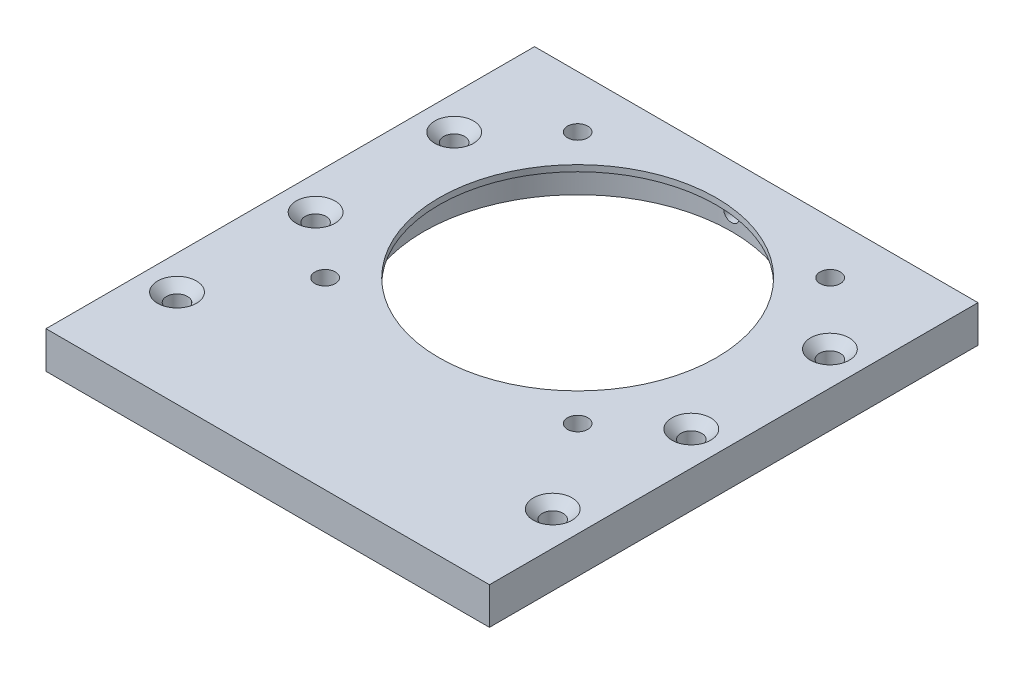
ISO-10303-21;
HEADER;
FILE_DESCRIPTION(('STEP AP214'),'2;1');
FILE_NAME('part.step','',(''),(''),'','','');
FILE_SCHEMA(('AUTOMOTIVE_DESIGN { 1 0 10303 214 1 1 1 1 }'));
ENDSEC;
DATA;
#1=APPLICATION_CONTEXT('core data for automotive mechanical design processes');
#2=APPLICATION_PROTOCOL_DEFINITION('international standard','automotive_design',2000,#1);
#3=PRODUCT_CONTEXT('',#1,'mechanical');
#4=PRODUCT('Part','Part','',(#3));
#5=PRODUCT_RELATED_PRODUCT_CATEGORY('part','',(#4));
#6=PRODUCT_DEFINITION_FORMATION('','',#4);
#7=PRODUCT_DEFINITION_CONTEXT('part definition',#1,'design');
#8=PRODUCT_DEFINITION('design','',#6,#7);
#9=PRODUCT_DEFINITION_SHAPE('','',#8);
#10=(LENGTH_UNIT() NAMED_UNIT(*) SI_UNIT(.MILLI.,.METRE.));
#11=(NAMED_UNIT(*) PLANE_ANGLE_UNIT() SI_UNIT($,.RADIAN.));
#12=(NAMED_UNIT(*) SI_UNIT($,.STERADIAN.) SOLID_ANGLE_UNIT());
#13=UNCERTAINTY_MEASURE_WITH_UNIT(LENGTH_MEASURE(1.E-05),#10,'distance_accuracy_value','');
#14=(GEOMETRIC_REPRESENTATION_CONTEXT(3) GLOBAL_UNCERTAINTY_ASSIGNED_CONTEXT((#13)) GLOBAL_UNIT_ASSIGNED_CONTEXT((#10,
#11,#12)) REPRESENTATION_CONTEXT('',''));
#15=CARTESIAN_POINT('',(0.,0.,0.));
#16=DIRECTION('',(0.,0.,1.));
#17=DIRECTION('',(1.,0.,0.));
#18=AXIS2_PLACEMENT_3D('',#15,#16,#17);
#19=CARTESIAN_POINT('',(36.,-3.,-29.));
#20=DIRECTION('',(0.,0.,1.));
#21=DIRECTION('',(1.,0.,0.));
#22=AXIS2_PLACEMENT_3D('',#19,#20,#21);
#23=PLANE('',#22);
#24=CARTESIAN_POINT('',(0.,-0.499999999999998,-29.));
#25=DIRECTION('',(0.,0.,-1.));
#26=DIRECTION('',(-1.,0.,0.));
#27=AXIS2_PLACEMENT_3D('',#24,#25,#26);
#28=CIRCLE('',#27,1.25);
#29=CARTESIAN_POINT('',(-1.25,-0.499999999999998,-29.));
#30=VERTEX_POINT('',#29);
#31=EDGE_CURVE('E207',#30,#30,#28,.T.);
#32=ORIENTED_EDGE('',*,*,#31,.F.);
#33=EDGE_LOOP('',(#32));
#34=FACE_BOUND('',#33,.T.);
#35=DIRECTION('',(0.,1.,0.));
#36=VECTOR('',#35,1.);
#37=CARTESIAN_POINT('',(-36.,-3.,-29.));
#38=LINE('',#37,#36);
#39=CARTESIAN_POINT('',(-36.,-3.,-29.));
#40=VERTEX_POINT('',#39);
#41=CARTESIAN_POINT('',(-36.,3.,-29.));
#42=VERTEX_POINT('',#41);
#43=EDGE_CURVE('E97',#40,#42,#38,.T.);
#44=ORIENTED_EDGE('',*,*,#43,.T.);
#45=DIRECTION('',(-1.,0.,0.));
#46=VECTOR('',#45,1.);
#47=CARTESIAN_POINT('',(36.,3.,-29.));
#48=LINE('',#47,#46);
#49=CARTESIAN_POINT('',(36.,3.,-29.));
#50=VERTEX_POINT('',#49);
#51=EDGE_CURVE('E11',#50,#42,#48,.T.);
#52=ORIENTED_EDGE('',*,*,#51,.F.);
#53=DIRECTION('',(0.,1.,0.));
#54=VECTOR('',#53,1.);
#55=CARTESIAN_POINT('',(36.,-3.,-29.));
#56=LINE('',#55,#54);
#57=CARTESIAN_POINT('',(36.,-3.,-29.));
#58=VERTEX_POINT('',#57);
#59=EDGE_CURVE('E85',#58,#50,#56,.T.);
#60=ORIENTED_EDGE('',*,*,#59,.F.);
#61=DIRECTION('',(-1.,0.,0.));
#62=VECTOR('',#61,1.);
#63=CARTESIAN_POINT('',(36.,-3.,-29.));
#64=LINE('',#63,#62);
#65=EDGE_CURVE('E93',#58,#40,#64,.T.);
#66=ORIENTED_EDGE('',*,*,#65,.T.);
#67=EDGE_LOOP('',(#44,#52,#60,#66));
#68=FACE_BOUND('',#67,.T.);
#69=ADVANCED_FACE('F34',(#34,#68),#23,.F.);
#70=CARTESIAN_POINT('',(36.,3.,50.32));
#71=DIRECTION('',(0.,-1.,0.));
#72=DIRECTION('',(0.,0.,-1.));
#73=AXIS2_PLACEMENT_3D('',#70,#71,#72);
#74=PLANE('',#73);
#75=CARTESIAN_POINT('',(20.5,3.00000000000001,20.5));
#76=DIRECTION('',(0.,-1.,0.));
#77=DIRECTION('',(0.,0.,-1.));
#78=AXIS2_PLACEMENT_3D('',#75,#76,#77);
#79=CIRCLE('',#78,1.64999999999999);
#80=CARTESIAN_POINT('',(20.5,3.00000000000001,18.85));
#81=VERTEX_POINT('',#80);
#82=EDGE_CURVE('E194',#81,#81,#79,.T.);
#83=ORIENTED_EDGE('',*,*,#82,.T.);
#84=EDGE_LOOP('',(#83));
#85=FACE_BOUND('',#84,.T.);
#86=CARTESIAN_POINT('',(-20.5,3.00000000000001,20.5));
#87=DIRECTION('',(0.,-1.,0.));
#88=DIRECTION('',(0.,0.,-1.));
#89=AXIS2_PLACEMENT_3D('',#86,#87,#88);
#90=CIRCLE('',#89,1.64999999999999);
#91=CARTESIAN_POINT('',(-20.5,3.00000000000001,18.85));
#92=VERTEX_POINT('',#91);
#93=EDGE_CURVE('E188',#92,#92,#90,.T.);
#94=ORIENTED_EDGE('',*,*,#93,.T.);
#95=EDGE_LOOP('',(#94));
#96=FACE_BOUND('',#95,.T.);
#97=CARTESIAN_POINT('',(-20.5,3.00000000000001,-20.5));
#98=DIRECTION('',(0.,-1.,0.));
#99=DIRECTION('',(0.,0.,-1.));
#100=AXIS2_PLACEMENT_3D('',#97,#98,#99);
#101=CIRCLE('',#100,1.64999999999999);
#102=CARTESIAN_POINT('',(-20.5,3.00000000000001,-22.15));
#103=VERTEX_POINT('',#102);
#104=EDGE_CURVE('E182',#103,#103,#101,.T.);
#105=ORIENTED_EDGE('',*,*,#104,.T.);
#106=EDGE_LOOP('',(#105));
#107=FACE_BOUND('',#106,.T.);
#108=CARTESIAN_POINT('',(20.5,3.00000000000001,-20.5));
#109=DIRECTION('',(0.,-1.,0.));
#110=DIRECTION('',(0.,0.,-1.));
#111=AXIS2_PLACEMENT_3D('',#108,#109,#110);
#112=CIRCLE('',#111,1.64999999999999);
#113=CARTESIAN_POINT('',(20.5,3.00000000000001,-22.15));
#114=VERTEX_POINT('',#113);
#115=EDGE_CURVE('E176',#114,#114,#112,.T.);
#116=ORIENTED_EDGE('',*,*,#115,.T.);
#117=EDGE_LOOP('',(#116));
#118=FACE_BOUND('',#117,.T.);
#119=CARTESIAN_POINT('',(-30.5,3.,12.0470053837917));
#120=DIRECTION('',(0.,1.,0.));
#121=DIRECTION('',(0.,0.,1.));
#122=AXIS2_PLACEMENT_3D('',#119,#120,#121);
#123=CIRCLE('',#122,3.15);
#124=CARTESIAN_POINT('',(-30.5,3.,15.1970053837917));
#125=VERTEX_POINT('',#124);
#126=EDGE_CURVE('E173',#125,#125,#123,.T.);
#127=ORIENTED_EDGE('',*,*,#126,.F.);
#128=EDGE_LOOP('',(#127));
#129=FACE_BOUND('',#128,.T.);
#130=CARTESIAN_POINT('',(-30.5,3.,34.5470053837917));
#131=DIRECTION('',(0.,1.,0.));
#132=DIRECTION('',(0.,0.,1.));
#133=AXIS2_PLACEMENT_3D('',#130,#131,#132);
#134=CIRCLE('',#133,3.15);
#135=CARTESIAN_POINT('',(-30.5,3.,37.6970053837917));
#136=VERTEX_POINT('',#135);
#137=EDGE_CURVE('E164',#136,#136,#134,.T.);
#138=ORIENTED_EDGE('',*,*,#137,.F.);
#139=EDGE_LOOP('',(#138));
#140=FACE_BOUND('',#139,.T.);
#141=CARTESIAN_POINT('',(30.5,3.,34.5470053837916));
#142=DIRECTION('',(0.,1.,0.));
#143=DIRECTION('',(0.,0.,1.));
#144=AXIS2_PLACEMENT_3D('',#141,#142,#143);
#145=CIRCLE('',#144,3.15);
#146=CARTESIAN_POINT('',(30.5,3.,37.6970053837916));
#147=VERTEX_POINT('',#146);
#148=EDGE_CURVE('E155',#147,#147,#145,.T.);
#149=ORIENTED_EDGE('',*,*,#148,.F.);
#150=EDGE_LOOP('',(#149));
#151=FACE_BOUND('',#150,.T.);
#152=CARTESIAN_POINT('',(30.5,3.,12.0470053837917));
#153=DIRECTION('',(0.,1.,0.));
#154=DIRECTION('',(0.,0.,1.));
#155=AXIS2_PLACEMENT_3D('',#152,#153,#154);
#156=CIRCLE('',#155,3.15);
#157=CARTESIAN_POINT('',(30.5,3.,15.1970053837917));
#158=VERTEX_POINT('',#157);
#159=EDGE_CURVE('E146',#158,#158,#156,.T.);
#160=ORIENTED_EDGE('',*,*,#159,.F.);
#161=EDGE_LOOP('',(#160));
#162=FACE_BOUND('',#161,.T.);
#163=CARTESIAN_POINT('',(-30.5,3.,-10.4529946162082));
#164=DIRECTION('',(0.,1.,0.));
#165=DIRECTION('',(0.,0.,1.));
#166=AXIS2_PLACEMENT_3D('',#163,#164,#165);
#167=CIRCLE('',#166,3.15);
#168=CARTESIAN_POINT('',(-30.5,3.,-7.30299461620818));
#169=VERTEX_POINT('',#168);
#170=EDGE_CURVE('E137',#169,#169,#167,.T.);
#171=ORIENTED_EDGE('',*,*,#170,.F.);
#172=EDGE_LOOP('',(#171));
#173=FACE_BOUND('',#172,.T.);
#174=CARTESIAN_POINT('',(30.5,3.,-10.4529946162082));
#175=DIRECTION('',(0.,1.,0.));
#176=DIRECTION('',(0.,0.,1.));
#177=AXIS2_PLACEMENT_3D('',#174,#175,#176);
#178=CIRCLE('',#177,3.15);
#179=CARTESIAN_POINT('',(30.5,3.,-7.30299461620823));
#180=VERTEX_POINT('',#179);
#181=EDGE_CURVE('E128',#180,#180,#178,.T.);
#182=ORIENTED_EDGE('',*,*,#181,.F.);
#183=EDGE_LOOP('',(#182));
#184=FACE_BOUND('',#183,.T.);
#185=CARTESIAN_POINT('',(0.,3.,0.));
#186=DIRECTION('',(0.,-1.,0.));
#187=DIRECTION('',(0.,0.,-1.));
#188=AXIS2_PLACEMENT_3D('',#185,#186,#187);
#189=CIRCLE('',#188,22.5);
#190=CARTESIAN_POINT('',(0.,3.,-22.5));
#191=VERTEX_POINT('',#190);
#192=EDGE_CURVE('E114',#191,#191,#189,.T.);
#193=ORIENTED_EDGE('',*,*,#192,.T.);
#194=EDGE_LOOP('',(#193));
#195=FACE_BOUND('',#194,.T.);
#196=DIRECTION('',(0.,0.,1.));
#197=VECTOR('',#196,1.);
#198=CARTESIAN_POINT('',(-36.,3.,50.32));
#199=LINE('',#198,#197);
#200=CARTESIAN_POINT('',(-36.,3.,50.32));
#201=VERTEX_POINT('',#200);
#202=EDGE_CURVE('E89',#42,#201,#199,.T.);
#203=ORIENTED_EDGE('',*,*,#202,.T.);
#204=DIRECTION('',(-1.,0.,0.));
#205=VECTOR('',#204,1.);
#206=CARTESIAN_POINT('',(36.,3.,50.32));
#207=LINE('',#206,#205);
#208=CARTESIAN_POINT('',(36.,3.,50.32));
#209=VERTEX_POINT('',#208);
#210=EDGE_CURVE('E42',#209,#201,#207,.T.);
#211=ORIENTED_EDGE('',*,*,#210,.F.);
#212=DIRECTION('',(0.,0.,1.));
#213=VECTOR('',#212,1.);
#214=CARTESIAN_POINT('',(36.,3.,50.32));
#215=LINE('',#214,#213);
#216=EDGE_CURVE('E80',#50,#209,#215,.T.);
#217=ORIENTED_EDGE('',*,*,#216,.F.);
#218=ORIENTED_EDGE('',*,*,#51,.T.);
#219=EDGE_LOOP('',(#203,#211,#217,#218));
#220=FACE_BOUND('',#219,.T.);
#221=ADVANCED_FACE('F88',(#85,#96,#107,#118,#129,#140,#151,#162,#173,#184,#195,#220),#74,.F.);
#222=CARTESIAN_POINT('',(36.,-3.,50.32));
#223=DIRECTION('',(0.,0.,-1.));
#224=DIRECTION('',(-1.,0.,0.));
#225=AXIS2_PLACEMENT_3D('',#222,#223,#224);
#226=PLANE('',#225);
#227=DIRECTION('',(0.,-1.,0.));
#228=VECTOR('',#227,1.);
#229=CARTESIAN_POINT('',(-36.,-3.,50.32));
#230=LINE('',#229,#228);
#231=CARTESIAN_POINT('',(-36.,-3.,50.32));
#232=VERTEX_POINT('',#231);
#233=EDGE_CURVE('E67',#201,#232,#230,.T.);
#234=ORIENTED_EDGE('',*,*,#233,.T.);
#235=DIRECTION('',(-1.,0.,0.));
#236=VECTOR('',#235,1.);
#237=CARTESIAN_POINT('',(36.,-3.,50.32));
#238=LINE('',#237,#236);
#239=CARTESIAN_POINT('',(36.,-3.,50.32));
#240=VERTEX_POINT('',#239);
#241=EDGE_CURVE('E90',#240,#232,#238,.T.);
#242=ORIENTED_EDGE('',*,*,#241,.F.);
#243=DIRECTION('',(0.,-1.,0.));
#244=VECTOR('',#243,1.);
#245=CARTESIAN_POINT('',(36.,-3.,50.32));
#246=LINE('',#245,#244);
#247=EDGE_CURVE('E83',#209,#240,#246,.T.);
#248=ORIENTED_EDGE('',*,*,#247,.F.);
#249=ORIENTED_EDGE('',*,*,#210,.T.);
#250=EDGE_LOOP('',(#234,#242,#248,#249));
#251=FACE_BOUND('',#250,.T.);
#252=ADVANCED_FACE('F91',(#251),#226,.F.);
#253=CARTESIAN_POINT('',(36.,-3.,50.32));
#254=DIRECTION('',(0.,1.,0.));
#255=DIRECTION('',(0.,0.,1.));
#256=AXIS2_PLACEMENT_3D('',#253,#254,#255);
#257=PLANE('',#256);
#258=CARTESIAN_POINT('',(20.5,-3.,20.5));
#259=DIRECTION('',(0.,-1.,0.));
#260=DIRECTION('',(0.,0.,-1.));
#261=AXIS2_PLACEMENT_3D('',#258,#259,#260);
#262=CIRCLE('',#261,1.64999999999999);
#263=CARTESIAN_POINT('',(20.5,-3.,18.85));
#264=VERTEX_POINT('',#263);
#265=EDGE_CURVE('E197',#264,#264,#262,.T.);
#266=ORIENTED_EDGE('',*,*,#265,.F.);
#267=EDGE_LOOP('',(#266));
#268=FACE_BOUND('',#267,.T.);
#269=CARTESIAN_POINT('',(-20.5,-3.,20.5));
#270=DIRECTION('',(0.,-1.,0.));
#271=DIRECTION('',(0.,0.,-1.));
#272=AXIS2_PLACEMENT_3D('',#269,#270,#271);
#273=CIRCLE('',#272,1.64999999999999);
#274=CARTESIAN_POINT('',(-20.5,-3.,18.85));
#275=VERTEX_POINT('',#274);
#276=EDGE_CURVE('E191',#275,#275,#273,.T.);
#277=ORIENTED_EDGE('',*,*,#276,.F.);
#278=EDGE_LOOP('',(#277));
#279=FACE_BOUND('',#278,.T.);
#280=CARTESIAN_POINT('',(-20.5,-3.,-20.5));
#281=DIRECTION('',(0.,-1.,0.));
#282=DIRECTION('',(0.,0.,-1.));
#283=AXIS2_PLACEMENT_3D('',#280,#281,#282);
#284=CIRCLE('',#283,1.64999999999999);
#285=CARTESIAN_POINT('',(-20.5,-3.,-22.15));
#286=VERTEX_POINT('',#285);
#287=EDGE_CURVE('E185',#286,#286,#284,.T.);
#288=ORIENTED_EDGE('',*,*,#287,.F.);
#289=EDGE_LOOP('',(#288));
#290=FACE_BOUND('',#289,.T.);
#291=CARTESIAN_POINT('',(20.5,-3.,-20.5));
#292=DIRECTION('',(0.,-1.,0.));
#293=DIRECTION('',(0.,0.,-1.));
#294=AXIS2_PLACEMENT_3D('',#291,#292,#293);
#295=CIRCLE('',#294,1.64999999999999);
#296=CARTESIAN_POINT('',(20.5,-3.,-22.15));
#297=VERTEX_POINT('',#296);
#298=EDGE_CURVE('E179',#297,#297,#295,.T.);
#299=ORIENTED_EDGE('',*,*,#298,.F.);
#300=EDGE_LOOP('',(#299));
#301=FACE_BOUND('',#300,.T.);
#302=CARTESIAN_POINT('',(-30.5,-3.,12.0470053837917));
#303=DIRECTION('',(0.,1.,0.));
#304=DIRECTION('',(0.,0.,1.));
#305=AXIS2_PLACEMENT_3D('',#302,#303,#304);
#306=CIRCLE('',#305,1.7);
#307=CARTESIAN_POINT('',(-30.5,-3.,13.7470053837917));
#308=VERTEX_POINT('',#307);
#309=EDGE_CURVE('E167',#308,#308,#306,.T.);
#310=ORIENTED_EDGE('',*,*,#309,.T.);
#311=EDGE_LOOP('',(#310));
#312=FACE_BOUND('',#311,.T.);
#313=CARTESIAN_POINT('',(-30.5,-3.,34.5470053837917));
#314=DIRECTION('',(0.,1.,0.));
#315=DIRECTION('',(0.,0.,1.));
#316=AXIS2_PLACEMENT_3D('',#313,#314,#315);
#317=CIRCLE('',#316,1.7);
#318=CARTESIAN_POINT('',(-30.5,-3.,36.2470053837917));
#319=VERTEX_POINT('',#318);
#320=EDGE_CURVE('E158',#319,#319,#317,.T.);
#321=ORIENTED_EDGE('',*,*,#320,.T.);
#322=EDGE_LOOP('',(#321));
#323=FACE_BOUND('',#322,.T.);
#324=CARTESIAN_POINT('',(30.5,-3.,34.5470053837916));
#325=DIRECTION('',(0.,1.,0.));
#326=DIRECTION('',(0.,0.,1.));
#327=AXIS2_PLACEMENT_3D('',#324,#325,#326);
#328=CIRCLE('',#327,1.7);
#329=CARTESIAN_POINT('',(30.5,-3.,36.2470053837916));
#330=VERTEX_POINT('',#329);
#331=EDGE_CURVE('E149',#330,#330,#328,.T.);
#332=ORIENTED_EDGE('',*,*,#331,.T.);
#333=EDGE_LOOP('',(#332));
#334=FACE_BOUND('',#333,.T.);
#335=CARTESIAN_POINT('',(30.5,-3.,12.0470053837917));
#336=DIRECTION('',(0.,1.,0.));
#337=DIRECTION('',(0.,0.,1.));
#338=AXIS2_PLACEMENT_3D('',#335,#336,#337);
#339=CIRCLE('',#338,1.7);
#340=CARTESIAN_POINT('',(30.5,-3.,13.7470053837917));
#341=VERTEX_POINT('',#340);
#342=EDGE_CURVE('E140',#341,#341,#339,.T.);
#343=ORIENTED_EDGE('',*,*,#342,.T.);
#344=EDGE_LOOP('',(#343));
#345=FACE_BOUND('',#344,.T.);
#346=CARTESIAN_POINT('',(-30.5,-3.,-10.4529946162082));
#347=DIRECTION('',(0.,1.,0.));
#348=DIRECTION('',(0.,0.,1.));
#349=AXIS2_PLACEMENT_3D('',#346,#347,#348);
#350=CIRCLE('',#349,1.7);
#351=CARTESIAN_POINT('',(-30.5,-3.,-8.75299461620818));
#352=VERTEX_POINT('',#351);
#353=EDGE_CURVE('E131',#352,#352,#350,.T.);
#354=ORIENTED_EDGE('',*,*,#353,.T.);
#355=EDGE_LOOP('',(#354));
#356=FACE_BOUND('',#355,.T.);
#357=CARTESIAN_POINT('',(30.5,-3.,-10.4529946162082));
#358=DIRECTION('',(0.,1.,0.));
#359=DIRECTION('',(0.,0.,1.));
#360=AXIS2_PLACEMENT_3D('',#357,#358,#359);
#361=CIRCLE('',#360,1.7);
#362=CARTESIAN_POINT('',(30.5,-3.,-8.75299461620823));
#363=VERTEX_POINT('',#362);
#364=EDGE_CURVE('E120',#363,#363,#361,.T.);
#365=ORIENTED_EDGE('',*,*,#364,.T.);
#366=EDGE_LOOP('',(#365));
#367=FACE_BOUND('',#366,.T.);
#368=CARTESIAN_POINT('',(0.,-3.,0.));
#369=DIRECTION('',(0.,-1.,0.));
#370=DIRECTION('',(0.,0.,-1.));
#371=AXIS2_PLACEMENT_3D('',#368,#369,#370);
#372=CIRCLE('',#371,25.);
#373=CARTESIAN_POINT('',(0.,-3.,-25.));
#374=VERTEX_POINT('',#373);
#375=EDGE_CURVE('E111',#374,#374,#372,.T.);
#376=ORIENTED_EDGE('',*,*,#375,.F.);
#377=EDGE_LOOP('',(#376));
#378=FACE_BOUND('',#377,.T.);
#379=DIRECTION('',(0.,0.,-1.));
#380=VECTOR('',#379,1.);
#381=CARTESIAN_POINT('',(-36.,-3.,50.32));
#382=LINE('',#381,#380);
#383=EDGE_CURVE('E73',#232,#40,#382,.T.);
#384=ORIENTED_EDGE('',*,*,#383,.T.);
#385=ORIENTED_EDGE('',*,*,#65,.F.);
#386=DIRECTION('',(0.,0.,-1.));
#387=VECTOR('',#386,1.);
#388=CARTESIAN_POINT('',(36.,-3.,50.32));
#389=LINE('',#388,#387);
#390=EDGE_CURVE('E50',#240,#58,#389,.T.);
#391=ORIENTED_EDGE('',*,*,#390,.F.);
#392=ORIENTED_EDGE('',*,*,#241,.T.);
#393=EDGE_LOOP('',(#384,#385,#391,#392));
#394=FACE_BOUND('',#393,.T.);
#395=ADVANCED_FACE('F105',(#268,#279,#290,#301,#312,#323,#334,#345,#356,#367,#378,#394),#257,.F.);
#396=CARTESIAN_POINT('',(36.,0.,0.));
#397=DIRECTION('',(-1.,0.,0.));
#398=DIRECTION('',(0.,0.,1.));
#399=AXIS2_PLACEMENT_3D('',#396,#397,#398);
#400=PLANE('',#399);
#401=ORIENTED_EDGE('',*,*,#59,.T.);
#402=ORIENTED_EDGE('',*,*,#216,.T.);
#403=ORIENTED_EDGE('',*,*,#247,.T.);
#404=ORIENTED_EDGE('',*,*,#390,.T.);
#405=EDGE_LOOP('',(#401,#402,#403,#404));
#406=FACE_BOUND('',#405,.T.);
#407=ADVANCED_FACE('F81',(#406),#400,.F.);
#408=CARTESIAN_POINT('',(-36.,0.,0.));
#409=DIRECTION('',(-1.,0.,0.));
#410=DIRECTION('',(0.,0.,1.));
#411=AXIS2_PLACEMENT_3D('',#408,#409,#410);
#412=PLANE('',#411);
#413=ORIENTED_EDGE('',*,*,#43,.F.);
#414=ORIENTED_EDGE('',*,*,#383,.F.);
#415=ORIENTED_EDGE('',*,*,#233,.F.);
#416=ORIENTED_EDGE('',*,*,#202,.F.);
#417=EDGE_LOOP('',(#413,#414,#415,#416));
#418=FACE_BOUND('',#417,.T.);
#419=ADVANCED_FACE('F108',(#418),#412,.T.);
#420=CARTESIAN_POINT('',(0.,2.,0.));
#421=DIRECTION('',(0.,-1.,0.));
#422=DIRECTION('',(0.,0.,-1.));
#423=AXIS2_PLACEMENT_3D('',#420,#421,#422);
#424=CYLINDRICAL_SURFACE('',#423,25.);
#425=CARTESIAN_POINT('',(0.,0.75,-25.));
#426=CARTESIAN_POINT('',(0.0701660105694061,0.749996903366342,-24.9999995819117));
#427=CARTESIAN_POINT('',(0.140381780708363,0.744072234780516,-24.9997014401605));
#428=CARTESIAN_POINT('',(0.278876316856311,0.720521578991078,-24.9985407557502));
#429=CARTESIAN_POINT('',(0.347152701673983,0.702881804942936,-24.9976775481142));
#430=CARTESIAN_POINT('',(0.479742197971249,0.656407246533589,-24.995484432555));
#431=CARTESIAN_POINT('',(0.544057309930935,0.627578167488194,-24.9941547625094));
#432=CARTESIAN_POINT('',(0.666917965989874,0.559552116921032,-24.9911784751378));
#433=CARTESIAN_POINT('',(0.725464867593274,0.520357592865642,-24.9895319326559));
#434=CARTESIAN_POINT('',(0.835203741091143,0.432669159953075,-24.9861052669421));
#435=CARTESIAN_POINT('',(0.88638916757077,0.384167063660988,-24.9843250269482));
#436=CARTESIAN_POINT('',(0.979896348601,0.279256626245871,-24.9808326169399));
#437=CARTESIAN_POINT('',(1.02221774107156,0.222847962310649,-24.9791204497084));
#438=CARTESIAN_POINT('',(1.09681354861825,0.103691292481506,-24.9759564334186));
#439=CARTESIAN_POINT('',(1.12908285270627,0.0409400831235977,-24.974504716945));
#440=CARTESIAN_POINT('',(1.18262568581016,-0.0890978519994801,-24.9720267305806));
#441=CARTESIAN_POINT('',(1.20389929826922,-0.156384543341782,-24.9710004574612));
#442=CARTESIAN_POINT('',(1.23482957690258,-0.29352321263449,-24.9694901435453));
#443=CARTESIAN_POINT('',(1.24449603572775,-0.363372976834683,-24.969005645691));
#444=CARTESIAN_POINT('',(1.25196782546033,-0.503705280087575,-24.9686321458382));
#445=CARTESIAN_POINT('',(1.24977324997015,-0.574187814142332,-24.9687431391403));
#446=CARTESIAN_POINT('',(1.23359342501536,-0.713718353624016,-24.9695476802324));
#447=CARTESIAN_POINT('',(1.21961875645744,-0.782767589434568,-24.9702407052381));
#448=CARTESIAN_POINT('',(1.18029183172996,-0.917538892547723,-24.9721303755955));
#449=CARTESIAN_POINT('',(1.15493952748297,-0.983260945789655,-24.9733270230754));
#450=CARTESIAN_POINT('',(1.09356490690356,-1.10954636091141,-24.9760896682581));
#451=CARTESIAN_POINT('',(1.05753776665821,-1.17010737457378,-24.9776558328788));
#452=CARTESIAN_POINT('',(0.975839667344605,-1.28432592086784,-24.9809808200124));
#453=CARTESIAN_POINT('',(0.930168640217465,-1.33798340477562,-24.9827396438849));
#454=CARTESIAN_POINT('',(0.830419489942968,-1.43693333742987,-24.9862540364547));
#455=CARTESIAN_POINT('',(0.776332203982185,-1.48221655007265,-24.9880095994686));
#456=CARTESIAN_POINT('',(0.661318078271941,-1.56306134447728,-24.9913177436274));
#457=CARTESIAN_POINT('',(0.60039123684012,-1.59862292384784,-24.9928703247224));
#458=CARTESIAN_POINT('',(0.473422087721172,-1.65901410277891,-24.995597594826));
#459=CARTESIAN_POINT('',(0.407379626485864,-1.68384338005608,-24.9967722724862));
#460=CARTESIAN_POINT('',(0.27205633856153,-1.72205910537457,-24.9986111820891));
#461=CARTESIAN_POINT('',(0.202775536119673,-1.73544563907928,-24.9992754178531));
#462=CARTESIAN_POINT('',(0.063022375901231,-1.75038449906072,-25.0000180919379));
#463=CARTESIAN_POINT('',(-0.00744861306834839,-1.75194960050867,-25.0000971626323));
#464=CARTESIAN_POINT('',(-0.147652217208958,-1.74323450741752,-24.9996622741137));
#465=CARTESIAN_POINT('',(-0.217384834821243,-1.73295435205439,-24.9991483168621));
#466=CARTESIAN_POINT('',(-0.35409644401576,-1.70085113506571,-24.9975856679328));
#467=CARTESIAN_POINT('',(-0.421076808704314,-1.67903390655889,-24.9965372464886));
#468=CARTESIAN_POINT('',(-0.55042488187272,-1.62448176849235,-24.9940237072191));
#469=CARTESIAN_POINT('',(-0.612792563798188,-1.59174679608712,-24.9925585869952));
#470=CARTESIAN_POINT('',(-0.73120353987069,-1.51625568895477,-24.9893748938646));
#471=CARTESIAN_POINT('',(-0.787241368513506,-1.47349099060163,-24.9876561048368));
#472=CARTESIAN_POINT('',(-0.891346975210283,-1.3791668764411,-24.9841593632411));
#473=CARTESIAN_POINT('',(-0.939414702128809,-1.32760740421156,-24.9823814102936));
#474=CARTESIAN_POINT('',(-1.0262586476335,-1.21710236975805,-24.9789649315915));
#475=CARTESIAN_POINT('',(-1.06502660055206,-1.15815030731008,-24.9773265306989));
#476=CARTESIAN_POINT('',(-1.13211402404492,-1.03456637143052,-24.9743758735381));
#477=CARTESIAN_POINT('',(-1.16043354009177,-0.969934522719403,-24.9730636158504));
#478=CARTESIAN_POINT('',(-1.20580579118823,-0.836856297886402,-24.970914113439));
#479=CARTESIAN_POINT('',(-1.22286379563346,-0.76841172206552,-24.9700766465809));
#480=CARTESIAN_POINT('',(-1.24524604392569,-0.629625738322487,-24.9689705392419));
#481=CARTESIAN_POINT('',(-1.25057035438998,-0.559284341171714,-24.9687018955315));
#482=CARTESIAN_POINT('',(-1.24933344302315,-0.418783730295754,-24.9687638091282));
#483=CARTESIAN_POINT('',(-1.24278522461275,-0.34862440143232,-24.9690937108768));
#484=CARTESIAN_POINT('',(-1.21801601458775,-0.210402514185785,-24.9703141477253));
#485=CARTESIAN_POINT('',(-1.19979500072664,-0.142339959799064,-24.9712046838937));
#486=CARTESIAN_POINT('',(-1.15220008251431,-0.0102409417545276,-24.97344587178));
#487=CARTESIAN_POINT('',(-1.12282609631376,0.053795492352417,-24.9747965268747));
#488=CARTESIAN_POINT('',(-1.05376129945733,0.176028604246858,-24.9778056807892));
#489=CARTESIAN_POINT('',(-1.01407080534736,0.234225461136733,-24.9794641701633));
#490=CARTESIAN_POINT('',(-0.925453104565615,0.343192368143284,-24.9829041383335));
#491=CARTESIAN_POINT('',(-0.876516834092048,0.393955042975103,-24.9846857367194));
#492=CARTESIAN_POINT('',(-0.770802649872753,0.48656044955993,-24.9881702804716));
#493=CARTESIAN_POINT('',(-0.714022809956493,0.528400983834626,-24.9898732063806));
#494=CARTESIAN_POINT('',(-0.594188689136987,0.60199397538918,-24.9930096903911));
#495=CARTESIAN_POINT('',(-0.531128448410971,0.633736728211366,-24.9944429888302));
#496=CARTESIAN_POINT('',(-0.400613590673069,0.686146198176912,-24.9968748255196));
#497=CARTESIAN_POINT('',(-0.333164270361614,0.706825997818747,-24.9978738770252));
#498=CARTESIAN_POINT('',(-0.221079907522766,0.731098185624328,-24.9990604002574));
#499=CARTESIAN_POINT('',(-0.177170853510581,0.738177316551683,-24.9994112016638));
#500=CARTESIAN_POINT('',(-0.0888478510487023,0.747629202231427,-24.9998811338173));
#501=CARTESIAN_POINT('',(-0.0444339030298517,0.750001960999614,-25.000000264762));
#502=CARTESIAN_POINT('',(0.,0.75,-25.));
#503=B_SPLINE_CURVE_WITH_KNOTS('',3,(#425,#426,#427,#428,#429,#430,#431,#432,#433,#434,#435,
#436,#437,#438,#439,#440,#441,#442,#443,#444,#445,#446,#447,#448,#449,#450,#451,#452,#453,#454,
#455,#456,#457,#458,#459,#460,#461,#462,#463,#464,#465,#466,#467,#468,#469,#470,#471,#472,#473,
#474,#475,#476,#477,#478,#479,#480,#481,#482,#483,#484,#485,#486,#487,#488,#489,#490,#491,#492,
#493,#494,#495,#496,#497,#498,#499,#500,#501,#502),.UNSPECIFIED.,.T.,.F.,(4,2,2,2,2,2,2,2,2,2,2,
2,2,2,2,2,2,2,2,2,2,2,2,2,2,2,2,2,2,2,2,2,2,2,2,2,2,2,4),(0.,0.210335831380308,
0.420919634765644,0.631396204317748,0.841823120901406,1.0524359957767,1.2630574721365,
1.47378586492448,1.68451265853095,1.89506154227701,2.10560876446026,2.31596707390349,
2.52632627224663,2.73678067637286,2.94723656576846,3.15792320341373,3.36860989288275,
3.57930290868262,3.78999434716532,4.00045806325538,4.21092108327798,4.42127779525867,
4.63163571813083,4.84217390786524,5.0527134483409,5.26343942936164,5.47416449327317,
5.68479088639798,5.89541608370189,6.10581073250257,6.31620578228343,6.52660237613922,
6.73699251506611,6.94758998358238,7.15823926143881,7.36909037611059,7.57969159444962,
7.71289070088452,7.84608969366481),.UNSPECIFIED.);
#504=CARTESIAN_POINT('',(0.,0.75,-25.));
#505=VERTEX_POINT('',#504);
#506=EDGE_CURVE('E200',#505,#505,#503,.T.);
#507=ORIENTED_EDGE('',*,*,#506,.T.);
#508=EDGE_LOOP('',(#507));
#509=FACE_BOUND('',#508,.T.);
#510=CARTESIAN_POINT('',(0.,2.,0.));
#511=DIRECTION('',(0.,-1.,0.));
#512=DIRECTION('',(0.,0.,-1.));
#513=AXIS2_PLACEMENT_3D('',#510,#511,#512);
#514=CIRCLE('',#513,25.);
#515=CARTESIAN_POINT('',(0.,2.,-25.));
#516=VERTEX_POINT('',#515);
#517=EDGE_CURVE('E100',#516,#516,#514,.T.);
#518=ORIENTED_EDGE('',*,*,#517,.F.);
#519=EDGE_LOOP('',(#518));
#520=FACE_BOUND('',#519,.T.);
#521=ORIENTED_EDGE('',*,*,#375,.T.);
#522=EDGE_LOOP('',(#521));
#523=FACE_BOUND('',#522,.T.);
#524=ADVANCED_FACE('F241',(#509,#520,#523),#424,.F.);
#525=CARTESIAN_POINT('',(0.,2.,0.));
#526=DIRECTION('',(0.,-1.,0.));
#527=DIRECTION('',(0.,0.,-1.));
#528=AXIS2_PLACEMENT_3D('',#525,#526,#527);
#529=PLANE('',#528);
#530=CARTESIAN_POINT('',(0.,2.,0.));
#531=DIRECTION('',(0.,-1.,0.));
#532=DIRECTION('',(0.,0.,-1.));
#533=AXIS2_PLACEMENT_3D('',#530,#531,#532);
#534=CIRCLE('',#533,22.5);
#535=CARTESIAN_POINT('',(0.,2.,-22.5));
#536=VERTEX_POINT('',#535);
#537=EDGE_CURVE('E117',#536,#536,#534,.T.);
#538=ORIENTED_EDGE('',*,*,#537,.F.);
#539=EDGE_LOOP('',(#538));
#540=FACE_BOUND('',#539,.T.);
#541=ORIENTED_EDGE('',*,*,#517,.T.);
#542=EDGE_LOOP('',(#541));
#543=FACE_BOUND('',#542,.T.);
#544=ADVANCED_FACE('F246',(#540,#543),#529,.T.);
#545=CARTESIAN_POINT('',(0.,3.,0.));
#546=DIRECTION('',(0.,-1.,0.));
#547=DIRECTION('',(0.,0.,-1.));
#548=AXIS2_PLACEMENT_3D('',#545,#546,#547);
#549=CYLINDRICAL_SURFACE('',#548,22.5);
#550=ORIENTED_EDGE('',*,*,#192,.F.);
#551=EDGE_LOOP('',(#550));
#552=FACE_BOUND('',#551,.T.);
#553=ORIENTED_EDGE('',*,*,#537,.T.);
#554=EDGE_LOOP('',(#553));
#555=FACE_BOUND('',#554,.T.);
#556=ADVANCED_FACE('F250',(#552,#555),#549,.F.);
#557=CARTESIAN_POINT('',(30.5,3.,-10.4529946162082));
#558=DIRECTION('',(0.,1.,0.));
#559=DIRECTION('',(0.,0.,1.));
#560=AXIS2_PLACEMENT_3D('',#557,#558,#559);
#561=CYLINDRICAL_SURFACE('',#560,1.69999999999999);
#562=ORIENTED_EDGE('',*,*,#364,.F.);
#563=EDGE_LOOP('',(#562));
#564=FACE_BOUND('',#563,.T.);
#565=CARTESIAN_POINT('',(30.5,1.54999999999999,-10.4529946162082));
#566=DIRECTION('',(0.,1.,0.));
#567=DIRECTION('',(0.,0.,1.));
#568=AXIS2_PLACEMENT_3D('',#565,#566,#567);
#569=CIRCLE('',#568,1.69999999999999);
#570=CARTESIAN_POINT('',(30.5,1.54999999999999,-8.75299461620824));
#571=VERTEX_POINT('',#570);
#572=EDGE_CURVE('E125',#571,#571,#569,.T.);
#573=ORIENTED_EDGE('',*,*,#572,.T.);
#574=EDGE_LOOP('',(#573));
#575=FACE_BOUND('',#574,.T.);
#576=ADVANCED_FACE('F254',(#564,#575),#561,.F.);
#577=CARTESIAN_POINT('',(30.5,3.,-10.4529946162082));
#578=DIRECTION('',(0.,1.,0.));
#579=DIRECTION('',(0.,0.,1.));
#580=AXIS2_PLACEMENT_3D('',#577,#578,#579);
#581=CONICAL_SURFACE('',#580,3.15,0.78539816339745);
#582=ORIENTED_EDGE('',*,*,#572,.F.);
#583=EDGE_LOOP('',(#582));
#584=FACE_BOUND('',#583,.T.);
#585=ORIENTED_EDGE('',*,*,#181,.T.);
#586=EDGE_LOOP('',(#585));
#587=FACE_BOUND('',#586,.T.);
#588=ADVANCED_FACE('F258',(#584,#587),#581,.F.);
#589=CARTESIAN_POINT('',(-30.5,3.,-10.4529946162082));
#590=DIRECTION('',(0.,1.,0.));
#591=DIRECTION('',(0.,0.,1.));
#592=AXIS2_PLACEMENT_3D('',#589,#590,#591);
#593=CYLINDRICAL_SURFACE('',#592,1.69999999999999);
#594=ORIENTED_EDGE('',*,*,#353,.F.);
#595=EDGE_LOOP('',(#594));
#596=FACE_BOUND('',#595,.T.);
#597=CARTESIAN_POINT('',(-30.5,1.54999999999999,-10.4529946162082));
#598=DIRECTION('',(0.,1.,0.));
#599=DIRECTION('',(0.,0.,1.));
#600=AXIS2_PLACEMENT_3D('',#597,#598,#599);
#601=CIRCLE('',#600,1.69999999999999);
#602=CARTESIAN_POINT('',(-30.5,1.54999999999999,-8.75299461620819));
#603=VERTEX_POINT('',#602);
#604=EDGE_CURVE('E134',#603,#603,#601,.T.);
#605=ORIENTED_EDGE('',*,*,#604,.T.);
#606=EDGE_LOOP('',(#605));
#607=FACE_BOUND('',#606,.T.);
#608=ADVANCED_FACE('F262',(#596,#607),#593,.F.);
#609=CARTESIAN_POINT('',(-30.5,3.,-10.4529946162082));
#610=DIRECTION('',(0.,1.,0.));
#611=DIRECTION('',(0.,0.,1.));
#612=AXIS2_PLACEMENT_3D('',#609,#610,#611);
#613=CONICAL_SURFACE('',#612,3.15,0.78539816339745);
#614=ORIENTED_EDGE('',*,*,#604,.F.);
#615=EDGE_LOOP('',(#614));
#616=FACE_BOUND('',#615,.T.);
#617=ORIENTED_EDGE('',*,*,#170,.T.);
#618=EDGE_LOOP('',(#617));
#619=FACE_BOUND('',#618,.T.);
#620=ADVANCED_FACE('F266',(#616,#619),#613,.F.);
#621=CARTESIAN_POINT('',(30.5,3.,12.0470053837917));
#622=DIRECTION('',(0.,1.,0.));
#623=DIRECTION('',(0.,0.,1.));
#624=AXIS2_PLACEMENT_3D('',#621,#622,#623);
#625=CYLINDRICAL_SURFACE('',#624,1.69999999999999);
#626=ORIENTED_EDGE('',*,*,#342,.F.);
#627=EDGE_LOOP('',(#626));
#628=FACE_BOUND('',#627,.T.);
#629=CARTESIAN_POINT('',(30.5,1.54999999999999,12.0470053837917));
#630=DIRECTION('',(0.,1.,0.));
#631=DIRECTION('',(0.,0.,1.));
#632=AXIS2_PLACEMENT_3D('',#629,#630,#631);
#633=CIRCLE('',#632,1.69999999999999);
#634=CARTESIAN_POINT('',(30.5,1.54999999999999,13.7470053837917));
#635=VERTEX_POINT('',#634);
#636=EDGE_CURVE('E143',#635,#635,#633,.T.);
#637=ORIENTED_EDGE('',*,*,#636,.T.);
#638=EDGE_LOOP('',(#637));
#639=FACE_BOUND('',#638,.T.);
#640=ADVANCED_FACE('F270',(#628,#639),#625,.F.);
#641=CARTESIAN_POINT('',(30.5,3.,12.0470053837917));
#642=DIRECTION('',(0.,1.,0.));
#643=DIRECTION('',(0.,0.,1.));
#644=AXIS2_PLACEMENT_3D('',#641,#642,#643);
#645=CONICAL_SURFACE('',#644,3.15,0.78539816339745);
#646=ORIENTED_EDGE('',*,*,#636,.F.);
#647=EDGE_LOOP('',(#646));
#648=FACE_BOUND('',#647,.T.);
#649=ORIENTED_EDGE('',*,*,#159,.T.);
#650=EDGE_LOOP('',(#649));
#651=FACE_BOUND('',#650,.T.);
#652=ADVANCED_FACE('F274',(#648,#651),#645,.F.);
#653=CARTESIAN_POINT('',(30.5,3.,34.5470053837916));
#654=DIRECTION('',(0.,1.,0.));
#655=DIRECTION('',(0.,0.,1.));
#656=AXIS2_PLACEMENT_3D('',#653,#654,#655);
#657=CYLINDRICAL_SURFACE('',#656,1.69999999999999);
#658=ORIENTED_EDGE('',*,*,#331,.F.);
#659=EDGE_LOOP('',(#658));
#660=FACE_BOUND('',#659,.T.);
#661=CARTESIAN_POINT('',(30.5,1.54999999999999,34.5470053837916));
#662=DIRECTION('',(0.,1.,0.));
#663=DIRECTION('',(0.,0.,1.));
#664=AXIS2_PLACEMENT_3D('',#661,#662,#663);
#665=CIRCLE('',#664,1.69999999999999);
#666=CARTESIAN_POINT('',(30.5,1.54999999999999,36.2470053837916));
#667=VERTEX_POINT('',#666);
#668=EDGE_CURVE('E152',#667,#667,#665,.T.);
#669=ORIENTED_EDGE('',*,*,#668,.T.);
#670=EDGE_LOOP('',(#669));
#671=FACE_BOUND('',#670,.T.);
#672=ADVANCED_FACE('F278',(#660,#671),#657,.F.);
#673=CARTESIAN_POINT('',(30.5,3.,34.5470053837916));
#674=DIRECTION('',(0.,1.,0.));
#675=DIRECTION('',(0.,0.,1.));
#676=AXIS2_PLACEMENT_3D('',#673,#674,#675);
#677=CONICAL_SURFACE('',#676,3.15,0.78539816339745);
#678=ORIENTED_EDGE('',*,*,#668,.F.);
#679=EDGE_LOOP('',(#678));
#680=FACE_BOUND('',#679,.T.);
#681=ORIENTED_EDGE('',*,*,#148,.T.);
#682=EDGE_LOOP('',(#681));
#683=FACE_BOUND('',#682,.T.);
#684=ADVANCED_FACE('F282',(#680,#683),#677,.F.);
#685=CARTESIAN_POINT('',(-30.5,3.,34.5470053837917));
#686=DIRECTION('',(0.,1.,0.));
#687=DIRECTION('',(0.,0.,1.));
#688=AXIS2_PLACEMENT_3D('',#685,#686,#687);
#689=CYLINDRICAL_SURFACE('',#688,1.69999999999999);
#690=ORIENTED_EDGE('',*,*,#320,.F.);
#691=EDGE_LOOP('',(#690));
#692=FACE_BOUND('',#691,.T.);
#693=CARTESIAN_POINT('',(-30.5,1.54999999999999,34.5470053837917));
#694=DIRECTION('',(0.,1.,0.));
#695=DIRECTION('',(0.,0.,1.));
#696=AXIS2_PLACEMENT_3D('',#693,#694,#695);
#697=CIRCLE('',#696,1.69999999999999);
#698=CARTESIAN_POINT('',(-30.5,1.54999999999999,36.2470053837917));
#699=VERTEX_POINT('',#698);
#700=EDGE_CURVE('E161',#699,#699,#697,.T.);
#701=ORIENTED_EDGE('',*,*,#700,.T.);
#702=EDGE_LOOP('',(#701));
#703=FACE_BOUND('',#702,.T.);
#704=ADVANCED_FACE('F286',(#692,#703),#689,.F.);
#705=CARTESIAN_POINT('',(-30.5,3.,34.5470053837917));
#706=DIRECTION('',(0.,1.,0.));
#707=DIRECTION('',(0.,0.,1.));
#708=AXIS2_PLACEMENT_3D('',#705,#706,#707);
#709=CONICAL_SURFACE('',#708,3.15,0.785398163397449);
#710=ORIENTED_EDGE('',*,*,#700,.F.);
#711=EDGE_LOOP('',(#710));
#712=FACE_BOUND('',#711,.T.);
#713=ORIENTED_EDGE('',*,*,#137,.T.);
#714=EDGE_LOOP('',(#713));
#715=FACE_BOUND('',#714,.T.);
#716=ADVANCED_FACE('F290',(#712,#715),#709,.F.);
#717=CARTESIAN_POINT('',(-30.5,3.,12.0470053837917));
#718=DIRECTION('',(0.,1.,0.));
#719=DIRECTION('',(0.,0.,1.));
#720=AXIS2_PLACEMENT_3D('',#717,#718,#719);
#721=CYLINDRICAL_SURFACE('',#720,1.69999999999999);
#722=ORIENTED_EDGE('',*,*,#309,.F.);
#723=EDGE_LOOP('',(#722));
#724=FACE_BOUND('',#723,.T.);
#725=CARTESIAN_POINT('',(-30.5,1.54999999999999,12.0470053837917));
#726=DIRECTION('',(0.,1.,0.));
#727=DIRECTION('',(0.,0.,1.));
#728=AXIS2_PLACEMENT_3D('',#725,#726,#727);
#729=CIRCLE('',#728,1.69999999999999);
#730=CARTESIAN_POINT('',(-30.5,1.54999999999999,13.7470053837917));
#731=VERTEX_POINT('',#730);
#732=EDGE_CURVE('E170',#731,#731,#729,.T.);
#733=ORIENTED_EDGE('',*,*,#732,.T.);
#734=EDGE_LOOP('',(#733));
#735=FACE_BOUND('',#734,.T.);
#736=ADVANCED_FACE('F294',(#724,#735),#721,.F.);
#737=CARTESIAN_POINT('',(-30.5,3.,12.0470053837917));
#738=DIRECTION('',(0.,1.,0.));
#739=DIRECTION('',(0.,0.,1.));
#740=AXIS2_PLACEMENT_3D('',#737,#738,#739);
#741=CONICAL_SURFACE('',#740,3.15,0.78539816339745);
#742=ORIENTED_EDGE('',*,*,#732,.F.);
#743=EDGE_LOOP('',(#742));
#744=FACE_BOUND('',#743,.T.);
#745=ORIENTED_EDGE('',*,*,#126,.T.);
#746=EDGE_LOOP('',(#745));
#747=FACE_BOUND('',#746,.T.);
#748=ADVANCED_FACE('F298',(#744,#747),#741,.F.);
#749=CARTESIAN_POINT('',(20.5,-3.,-20.5));
#750=DIRECTION('',(0.,-1.,0.));
#751=DIRECTION('',(0.,0.,-1.));
#752=AXIS2_PLACEMENT_3D('',#749,#750,#751);
#753=CYLINDRICAL_SURFACE('',#752,1.64999999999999);
#754=ORIENTED_EDGE('',*,*,#115,.F.);
#755=EDGE_LOOP('',(#754));
#756=FACE_BOUND('',#755,.T.);
#757=ORIENTED_EDGE('',*,*,#298,.T.);
#758=EDGE_LOOP('',(#757));
#759=FACE_BOUND('',#758,.T.);
#760=ADVANCED_FACE('F302',(#756,#759),#753,.F.);
#761=CARTESIAN_POINT('',(-20.5,-3.,-20.5));
#762=DIRECTION('',(0.,-1.,0.));
#763=DIRECTION('',(0.,0.,-1.));
#764=AXIS2_PLACEMENT_3D('',#761,#762,#763);
#765=CYLINDRICAL_SURFACE('',#764,1.64999999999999);
#766=ORIENTED_EDGE('',*,*,#104,.F.);
#767=EDGE_LOOP('',(#766));
#768=FACE_BOUND('',#767,.T.);
#769=ORIENTED_EDGE('',*,*,#287,.T.);
#770=EDGE_LOOP('',(#769));
#771=FACE_BOUND('',#770,.T.);
#772=ADVANCED_FACE('F306',(#768,#771),#765,.F.);
#773=CARTESIAN_POINT('',(-20.5,-3.,20.5));
#774=DIRECTION('',(0.,-1.,0.));
#775=DIRECTION('',(0.,0.,-1.));
#776=AXIS2_PLACEMENT_3D('',#773,#774,#775);
#777=CYLINDRICAL_SURFACE('',#776,1.64999999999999);
#778=ORIENTED_EDGE('',*,*,#93,.F.);
#779=EDGE_LOOP('',(#778));
#780=FACE_BOUND('',#779,.T.);
#781=ORIENTED_EDGE('',*,*,#276,.T.);
#782=EDGE_LOOP('',(#781));
#783=FACE_BOUND('',#782,.T.);
#784=ADVANCED_FACE('F218',(#780,#783),#777,.F.);
#785=CARTESIAN_POINT('',(20.5,-3.,20.5));
#786=DIRECTION('',(0.,-1.,0.));
#787=DIRECTION('',(0.,0.,-1.));
#788=AXIS2_PLACEMENT_3D('',#785,#786,#787);
#789=CYLINDRICAL_SURFACE('',#788,1.64999999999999);
#790=ORIENTED_EDGE('',*,*,#82,.F.);
#791=EDGE_LOOP('',(#790));
#792=FACE_BOUND('',#791,.T.);
#793=ORIENTED_EDGE('',*,*,#265,.T.);
#794=EDGE_LOOP('',(#793));
#795=FACE_BOUND('',#794,.T.);
#796=ADVANCED_FACE('F213',(#792,#795),#789,.F.);
#797=CARTESIAN_POINT('',(0.,-0.499999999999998,-29.));
#798=DIRECTION('',(0.,0.,-1.));
#799=DIRECTION('',(-1.,0.,0.));
#800=AXIS2_PLACEMENT_3D('',#797,#798,#799);
#801=CYLINDRICAL_SURFACE('',#800,1.25);
#802=ORIENTED_EDGE('',*,*,#506,.F.);
#803=EDGE_LOOP('',(#802));
#804=FACE_BOUND('',#803,.T.);
#805=ORIENTED_EDGE('',*,*,#31,.T.);
#806=EDGE_LOOP('',(#805));
#807=FACE_BOUND('',#806,.T.);
#808=ADVANCED_FACE('F210',(#804,#807),#801,.F.);
#809=CLOSED_SHELL('',(#69,#221,#252,#395,#407,#419,#524,#544,#556,#576,#588,#608,#620,#640,#652,
#672,#684,#704,#716,#736,#748,#760,#772,#784,#796,#808));
#810=MANIFOLD_SOLID_BREP('B2',#809);
#811=ADVANCED_BREP_SHAPE_REPRESENTATION('',(#18,#810),#14);
#812=SHAPE_DEFINITION_REPRESENTATION(#9,#811);
ENDSEC;
END-ISO-10303-21;
